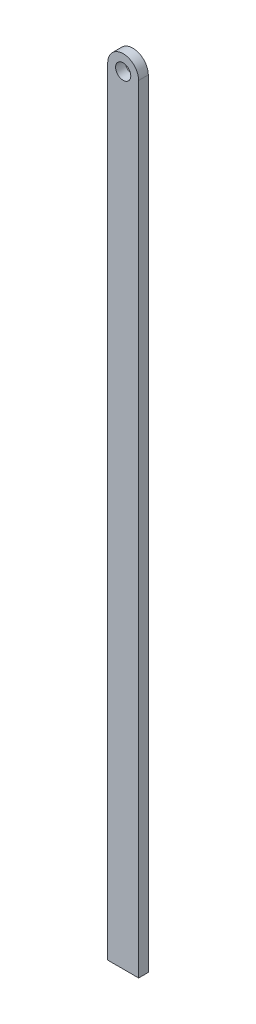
ISO-10303-21;
HEADER;
FILE_DESCRIPTION(('STEP AP214'),'2;1');
FILE_NAME('part.step','',(''),(''),'','','');
FILE_SCHEMA(('AUTOMOTIVE_DESIGN { 1 0 10303 214 1 1 1 1 }'));
ENDSEC;
DATA;
#1=APPLICATION_CONTEXT('core data for automotive mechanical design processes');
#2=APPLICATION_PROTOCOL_DEFINITION('international standard','automotive_design',2000,#1);
#3=PRODUCT_CONTEXT('',#1,'mechanical');
#4=PRODUCT('Part','Part','',(#3));
#5=PRODUCT_RELATED_PRODUCT_CATEGORY('part','',(#4));
#6=PRODUCT_DEFINITION_FORMATION('','',#4);
#7=PRODUCT_DEFINITION_CONTEXT('part definition',#1,'design');
#8=PRODUCT_DEFINITION('design','',#6,#7);
#9=PRODUCT_DEFINITION_SHAPE('','',#8);
#10=(LENGTH_UNIT() NAMED_UNIT(*) SI_UNIT(.MILLI.,.METRE.));
#11=(NAMED_UNIT(*) PLANE_ANGLE_UNIT() SI_UNIT($,.RADIAN.));
#12=(NAMED_UNIT(*) SI_UNIT($,.STERADIAN.) SOLID_ANGLE_UNIT());
#13=UNCERTAINTY_MEASURE_WITH_UNIT(LENGTH_MEASURE(1.E-05),#10,'distance_accuracy_value','');
#14=(GEOMETRIC_REPRESENTATION_CONTEXT(3) GLOBAL_UNCERTAINTY_ASSIGNED_CONTEXT((#13)) GLOBAL_UNIT_ASSIGNED_CONTEXT((#10,
#11,#12)) REPRESENTATION_CONTEXT('',''));
#15=CARTESIAN_POINT('',(0.,0.,0.));
#16=DIRECTION('',(0.,0.,1.));
#17=DIRECTION('',(1.,0.,0.));
#18=AXIS2_PLACEMENT_3D('',#15,#16,#17);
#19=CARTESIAN_POINT('',(-14.45,0.,0.762));
#20=DIRECTION('',(0.,0.,1.));
#21=DIRECTION('',(1.,0.,0.));
#22=AXIS2_PLACEMENT_3D('',#19,#20,#21);
#23=PLANE('',#22);
#24=CARTESIAN_POINT('',(-14.45,0.,0.762));
#25=DIRECTION('',(0.,0.,1.));
#26=DIRECTION('',(1.,0.,0.));
#27=AXIS2_PLACEMENT_3D('',#24,#25,#26);
#28=CIRCLE('',#27,1.22049869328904);
#29=CARTESIAN_POINT('',(-13.229501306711,0.,0.762));
#30=VERTEX_POINT('',#29);
#31=CARTESIAN_POINT('',(-15.670498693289,0.,0.762));
#32=VERTEX_POINT('',#31);
#33=EDGE_CURVE('E85',#30,#32,#28,.T.);
#34=ORIENTED_EDGE('',*,*,#33,.T.);
#35=DIRECTION('',(0.,-1.,0.));
#36=VECTOR('',#35,1.);
#37=CARTESIAN_POINT('',(-15.670498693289,-61.3385309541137,0.762));
#38=LINE('',#37,#36);
#39=CARTESIAN_POINT('',(-15.670498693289,-61.3385309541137,0.762));
#40=VERTEX_POINT('',#39);
#41=EDGE_CURVE('E80',#32,#40,#38,.T.);
#42=ORIENTED_EDGE('',*,*,#41,.T.);
#43=DIRECTION('',(1.,0.,0.));
#44=VECTOR('',#43,1.);
#45=CARTESIAN_POINT('',(-13.229501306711,-61.3385309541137,0.762));
#46=LINE('',#45,#44);
#47=CARTESIAN_POINT('',(-13.229501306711,-61.3385309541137,0.762));
#48=VERTEX_POINT('',#47);
#49=EDGE_CURVE('E83',#40,#48,#46,.T.);
#50=ORIENTED_EDGE('',*,*,#49,.T.);
#51=DIRECTION('',(0.,1.,0.));
#52=VECTOR('',#51,1.);
#53=CARTESIAN_POINT('',(-13.229501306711,0.,0.762));
#54=LINE('',#53,#52);
#55=EDGE_CURVE('E50',#48,#30,#54,.T.);
#56=ORIENTED_EDGE('',*,*,#55,.T.);
#57=EDGE_LOOP('',(#34,#42,#50,#56));
#58=FACE_BOUND('',#57,.T.);
#59=CARTESIAN_POINT('',(-14.45,0.,0.762));
#60=DIRECTION('',(0.,0.,1.));
#61=DIRECTION('',(1.,0.,0.));
#62=AXIS2_PLACEMENT_3D('',#59,#60,#61);
#63=CIRCLE('',#62,0.600000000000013);
#64=CARTESIAN_POINT('',(-13.85,0.,0.762));
#65=VERTEX_POINT('',#64);
#66=EDGE_CURVE('E100',#65,#65,#63,.T.);
#67=ORIENTED_EDGE('',*,*,#66,.F.);
#68=EDGE_LOOP('',(#67));
#69=FACE_BOUND('',#68,.T.);
#70=ADVANCED_FACE('F33',(#58,#69),#23,.T.);
#71=CARTESIAN_POINT('',(-14.45,0.,0.));
#72=DIRECTION('',(0.,0.,1.));
#73=DIRECTION('',(1.,0.,0.));
#74=AXIS2_PLACEMENT_3D('',#71,#72,#73);
#75=PLANE('',#74);
#76=CARTESIAN_POINT('',(-14.45,0.,0.));
#77=DIRECTION('',(0.,0.,1.));
#78=DIRECTION('',(1.,0.,0.));
#79=AXIS2_PLACEMENT_3D('',#76,#77,#78);
#80=CIRCLE('',#79,1.22049869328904);
#81=CARTESIAN_POINT('',(-13.229501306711,0.,0.));
#82=VERTEX_POINT('',#81);
#83=CARTESIAN_POINT('',(-15.670498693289,0.,0.));
#84=VERTEX_POINT('',#83);
#85=EDGE_CURVE('E97',#82,#84,#80,.T.);
#86=ORIENTED_EDGE('',*,*,#85,.F.);
#87=DIRECTION('',(0.,1.,0.));
#88=VECTOR('',#87,1.);
#89=CARTESIAN_POINT('',(-13.229501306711,0.,0.));
#90=LINE('',#89,#88);
#91=CARTESIAN_POINT('',(-13.229501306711,-61.3385309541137,0.));
#92=VERTEX_POINT('',#91);
#93=EDGE_CURVE('E73',#92,#82,#90,.T.);
#94=ORIENTED_EDGE('',*,*,#93,.F.);
#95=DIRECTION('',(1.,0.,0.));
#96=VECTOR('',#95,1.);
#97=CARTESIAN_POINT('',(-13.229501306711,-61.3385309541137,0.));
#98=LINE('',#97,#96);
#99=CARTESIAN_POINT('',(-15.670498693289,-61.3385309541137,0.));
#100=VERTEX_POINT('',#99);
#101=EDGE_CURVE('E67',#100,#92,#98,.T.);
#102=ORIENTED_EDGE('',*,*,#101,.F.);
#103=DIRECTION('',(0.,-1.,0.));
#104=VECTOR('',#103,1.);
#105=CARTESIAN_POINT('',(-15.670498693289,-61.3385309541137,0.));
#106=LINE('',#105,#104);
#107=EDGE_CURVE('E89',#84,#100,#106,.T.);
#108=ORIENTED_EDGE('',*,*,#107,.F.);
#109=EDGE_LOOP('',(#86,#94,#102,#108));
#110=FACE_BOUND('',#109,.T.);
#111=CARTESIAN_POINT('',(-14.45,0.,0.));
#112=DIRECTION('',(0.,0.,1.));
#113=DIRECTION('',(1.,0.,0.));
#114=AXIS2_PLACEMENT_3D('',#111,#112,#113);
#115=CIRCLE('',#114,0.600000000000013);
#116=CARTESIAN_POINT('',(-13.85,0.,0.));
#117=VERTEX_POINT('',#116);
#118=EDGE_CURVE('E112',#117,#117,#115,.T.);
#119=ORIENTED_EDGE('',*,*,#118,.T.);
#120=EDGE_LOOP('',(#119));
#121=FACE_BOUND('',#120,.T.);
#122=ADVANCED_FACE('F108',(#110,#121),#75,.F.);
#123=CARTESIAN_POINT('',(-14.45,0.,0.762));
#124=DIRECTION('',(0.,0.,-1.));
#125=DIRECTION('',(-1.,0.,0.));
#126=AXIS2_PLACEMENT_3D('',#123,#124,#125);
#127=CYLINDRICAL_SURFACE('',#126,1.22049869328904);
#128=ORIENTED_EDGE('',*,*,#85,.T.);
#129=DIRECTION('',(0.,0.,-1.));
#130=VECTOR('',#129,1.);
#131=CARTESIAN_POINT('',(-15.670498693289,0.,0.762));
#132=LINE('',#131,#130);
#133=EDGE_CURVE('E11',#32,#84,#132,.T.);
#134=ORIENTED_EDGE('',*,*,#133,.F.);
#135=ORIENTED_EDGE('',*,*,#33,.F.);
#136=DIRECTION('',(0.,0.,-1.));
#137=VECTOR('',#136,1.);
#138=CARTESIAN_POINT('',(-13.229501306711,0.,0.762));
#139=LINE('',#138,#137);
#140=EDGE_CURVE('E93',#30,#82,#139,.T.);
#141=ORIENTED_EDGE('',*,*,#140,.T.);
#142=EDGE_LOOP('',(#128,#134,#135,#141));
#143=FACE_BOUND('',#142,.T.);
#144=ADVANCED_FACE('F35',(#143),#127,.T.);
#145=CARTESIAN_POINT('',(-15.670498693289,-61.3385309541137,0.762));
#146=DIRECTION('',(1.,0.,0.));
#147=DIRECTION('',(0.,0.,-1.));
#148=AXIS2_PLACEMENT_3D('',#145,#146,#147);
#149=PLANE('',#148);
#150=ORIENTED_EDGE('',*,*,#107,.T.);
#151=DIRECTION('',(0.,0.,-1.));
#152=VECTOR('',#151,1.);
#153=CARTESIAN_POINT('',(-15.670498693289,-61.3385309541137,0.762));
#154=LINE('',#153,#152);
#155=EDGE_CURVE('E42',#40,#100,#154,.T.);
#156=ORIENTED_EDGE('',*,*,#155,.F.);
#157=ORIENTED_EDGE('',*,*,#41,.F.);
#158=ORIENTED_EDGE('',*,*,#133,.T.);
#159=EDGE_LOOP('',(#150,#156,#157,#158));
#160=FACE_BOUND('',#159,.T.);
#161=ADVANCED_FACE('F88',(#160),#149,.F.);
#162=CARTESIAN_POINT('',(-13.229501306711,-61.3385309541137,0.762));
#163=DIRECTION('',(0.,1.,0.));
#164=DIRECTION('',(0.,0.,1.));
#165=AXIS2_PLACEMENT_3D('',#162,#163,#164);
#166=PLANE('',#165);
#167=ORIENTED_EDGE('',*,*,#101,.T.);
#168=DIRECTION('',(0.,0.,-1.));
#169=VECTOR('',#168,1.);
#170=CARTESIAN_POINT('',(-13.229501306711,-61.3385309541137,0.762));
#171=LINE('',#170,#169);
#172=EDGE_CURVE('E90',#48,#92,#171,.T.);
#173=ORIENTED_EDGE('',*,*,#172,.F.);
#174=ORIENTED_EDGE('',*,*,#49,.F.);
#175=ORIENTED_EDGE('',*,*,#155,.T.);
#176=EDGE_LOOP('',(#167,#173,#174,#175));
#177=FACE_BOUND('',#176,.T.);
#178=ADVANCED_FACE('F91',(#177),#166,.F.);
#179=CARTESIAN_POINT('',(-13.229501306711,0.,0.762));
#180=DIRECTION('',(-1.,0.,0.));
#181=DIRECTION('',(0.,0.,1.));
#182=AXIS2_PLACEMENT_3D('',#179,#180,#181);
#183=PLANE('',#182);
#184=ORIENTED_EDGE('',*,*,#93,.T.);
#185=ORIENTED_EDGE('',*,*,#140,.F.);
#186=ORIENTED_EDGE('',*,*,#55,.F.);
#187=ORIENTED_EDGE('',*,*,#172,.T.);
#188=EDGE_LOOP('',(#184,#185,#186,#187));
#189=FACE_BOUND('',#188,.T.);
#190=ADVANCED_FACE('F105',(#189),#183,.F.);
#191=CARTESIAN_POINT('',(-14.45,0.,0.762));
#192=DIRECTION('',(0.,0.,-1.));
#193=DIRECTION('',(-1.,0.,0.));
#194=AXIS2_PLACEMENT_3D('',#191,#192,#193);
#195=CYLINDRICAL_SURFACE('',#194,0.600000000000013);
#196=ORIENTED_EDGE('',*,*,#66,.T.);
#197=EDGE_LOOP('',(#196));
#198=FACE_BOUND('',#197,.T.);
#199=ORIENTED_EDGE('',*,*,#118,.F.);
#200=EDGE_LOOP('',(#199));
#201=FACE_BOUND('',#200,.T.);
#202=ADVANCED_FACE('F118',(#198,#201),#195,.F.);
#203=CLOSED_SHELL('',(#70,#122,#144,#161,#178,#190,#202));
#204=MANIFOLD_SOLID_BREP('B2',#203);
#205=ADVANCED_BREP_SHAPE_REPRESENTATION('',(#18,#204),#14);
#206=SHAPE_DEFINITION_REPRESENTATION(#9,#205);
ENDSEC;
END-ISO-10303-21;
